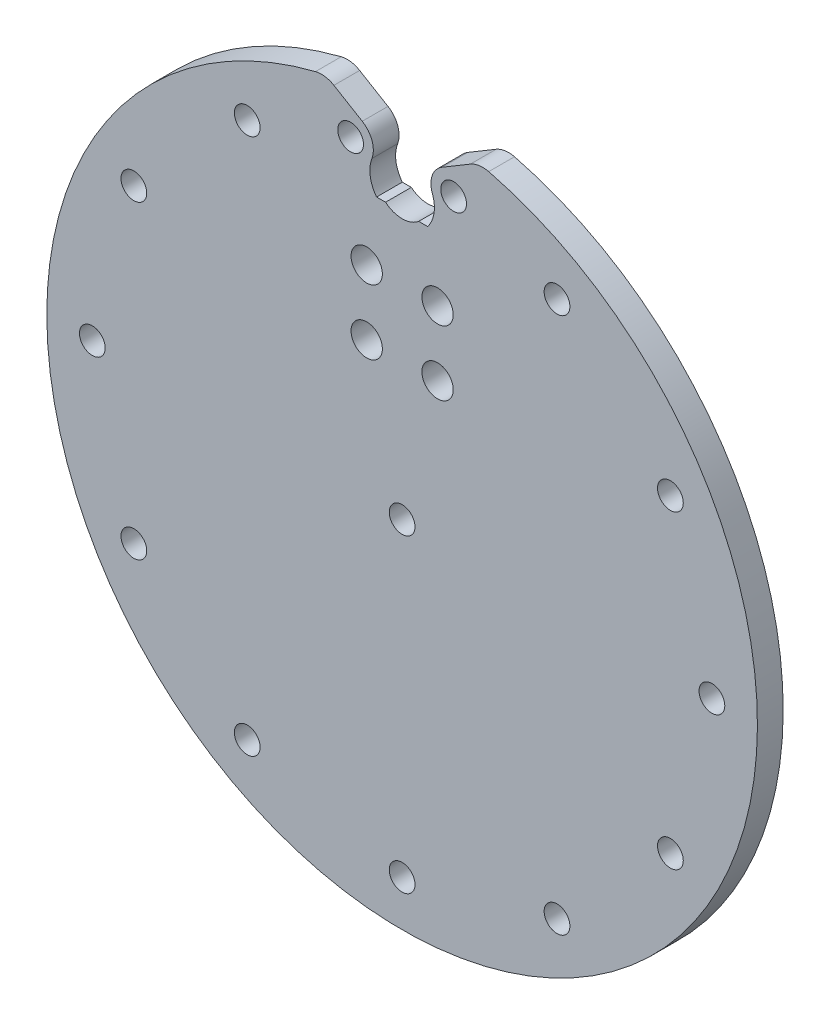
from build123d import *

# Parameters (mm, degrees)
SKETCH2_R           = 1.5875
SKETCH2_R_2         = 1.9304
BOSS_EXTRUDE1_DEPTH = 3.175
FILLET1_R           = 3


with BuildPart() as part:
    # Sketch2 → Boss-Extrude1 (new body)
    with BuildSketch(Plane.XY):
        with BuildLine():
            Line((-2.043459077, 32.862411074), (-3.152062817, 32.862411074))
            ThreePointArc((-3.152062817, 32.862411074), (-3.935695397, 34.700210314), (-3.727581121, 36.687236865))
            ThreePointArc((-3.727581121, 36.687236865), (-3.707901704, 38.595514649), (-4.915554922, 40.073176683))
            Line((-4.915554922, 40.073176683), (-9.456944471, 42.782244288))
            ThreePointArc((-9.456944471, 42.782244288), (0, -43.815), (9.456944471, 42.782244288))
            Line((9.456944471, 42.782244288), (4.915554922, 40.073176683))
            ThreePointArc((4.915554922, 40.073176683), (3.707901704, 38.595514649), (3.727581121, 36.687236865))
            ThreePointArc((3.727581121, 36.687236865), (3.935695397, 34.700210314), (3.152062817, 32.862411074))
            Line((3.152062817, 32.862411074), (2.043459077, 32.862411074))
            ThreePointArc((2.043459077, 32.862411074), (0, 32.117411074), (-2.043459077, 32.862411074))
        make_face()
        with Locations((-33.082170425, -19.1)):
            Circle(SKETCH2_R, mode=Mode.SUBTRACT)
        with Locations((-19.1, -33.082170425)):
            Circle(SKETCH2_R, mode=Mode.SUBTRACT)
        with Locations((0, -38.2)):
            Circle(SKETCH2_R, mode=Mode.SUBTRACT)
        with Locations((19.1, -33.082170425)):
            Circle(SKETCH2_R, mode=Mode.SUBTRACT)
        with Locations((33.082170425, -19.1)):
            Circle(SKETCH2_R, mode=Mode.SUBTRACT)
        with Locations((38.2, 0)):
            Circle(SKETCH2_R, mode=Mode.SUBTRACT)
        with Locations((-38.2, 0)):
            Circle(SKETCH2_R, mode=Mode.SUBTRACT)
        with Locations((-33.082170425, 19.1)):
            Circle(SKETCH2_R, mode=Mode.SUBTRACT)
        with Locations((-19.1, 33.082170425)):
            Circle(SKETCH2_R, mode=Mode.SUBTRACT)
        with Locations((33.082170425, 19.1)):
            Circle(SKETCH2_R, mode=Mode.SUBTRACT)
        with Locations((19.1, 33.082170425)):
            Circle(SKETCH2_R, mode=Mode.SUBTRACT)
        with Locations((-6.35, 37.668521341)):
            Circle(SKETCH2_R, mode=Mode.SUBTRACT)
        with Locations((-4.3688, 17)):
            Circle(SKETCH2_R_2, mode=Mode.SUBTRACT)
        with Locations((-4.3688, 25)):
            Circle(SKETCH2_R_2, mode=Mode.SUBTRACT)
        with Locations((4.3688, 25)):
            Circle(SKETCH2_R_2, mode=Mode.SUBTRACT)
        with Locations((4.3688, 17)):
            Circle(SKETCH2_R_2, mode=Mode.SUBTRACT)
        with Locations((6.35, 37.668521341)):
            Circle(SKETCH2_R, mode=Mode.SUBTRACT)
        Circle(SKETCH2_R, mode=Mode.SUBTRACT)
    extrude(amount=BOSS_EXTRUDE1_DEPTH)

    # Fillet1
    fillet1_edges = [part.edges().sort_by_distance(p)[0] for p in [
        (-9.456944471, 42.782244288, 1.5875),
        (9.456944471, 42.782244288, 1.5875),
    ]]
    fillet(fillet1_edges, radius=FILLET1_R)


solid = part.part
